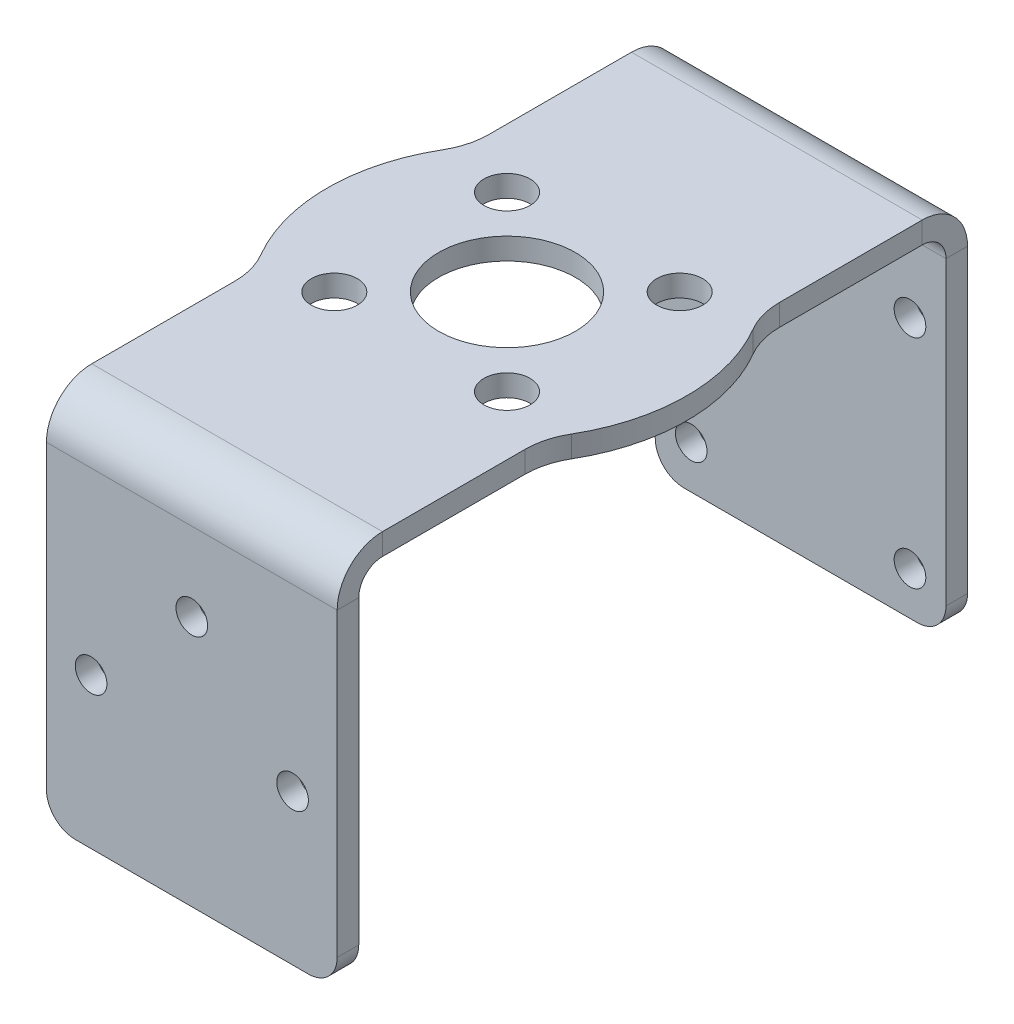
ISO-10303-21;
HEADER;
FILE_DESCRIPTION(('STEP AP214'),'2;1');
FILE_NAME('part.step','',(''),(''),'','','');
FILE_SCHEMA(('AUTOMOTIVE_DESIGN { 1 0 10303 214 1 1 1 1 }'));
ENDSEC;
DATA;
#1=APPLICATION_CONTEXT('core data for automotive mechanical design processes');
#2=APPLICATION_PROTOCOL_DEFINITION('international standard','automotive_design',2000,#1);
#3=PRODUCT_CONTEXT('',#1,'mechanical');
#4=PRODUCT('Part','Part','',(#3));
#5=PRODUCT_RELATED_PRODUCT_CATEGORY('part','',(#4));
#6=PRODUCT_DEFINITION_FORMATION('','',#4);
#7=PRODUCT_DEFINITION_CONTEXT('part definition',#1,'design');
#8=PRODUCT_DEFINITION('design','',#6,#7);
#9=PRODUCT_DEFINITION_SHAPE('','',#8);
#10=(LENGTH_UNIT() NAMED_UNIT(*) SI_UNIT(.MILLI.,.METRE.));
#11=(NAMED_UNIT(*) PLANE_ANGLE_UNIT() SI_UNIT($,.RADIAN.));
#12=(NAMED_UNIT(*) SI_UNIT($,.STERADIAN.) SOLID_ANGLE_UNIT());
#13=UNCERTAINTY_MEASURE_WITH_UNIT(LENGTH_MEASURE(1.E-05),#10,'distance_accuracy_value','');
#14=(GEOMETRIC_REPRESENTATION_CONTEXT(3) GLOBAL_UNCERTAINTY_ASSIGNED_CONTEXT((#13)) GLOBAL_UNIT_ASSIGNED_CONTEXT((#10,
#11,#12)) REPRESENTATION_CONTEXT('',''));
#15=CARTESIAN_POINT('',(0.,0.,0.));
#16=DIRECTION('',(0.,0.,1.));
#17=DIRECTION('',(1.,0.,0.));
#18=AXIS2_PLACEMENT_3D('',#15,#16,#17);
#19=CARTESIAN_POINT('',(10.1,-1.5,20.4));
#20=DIRECTION('',(1.,0.,0.));
#21=DIRECTION('',(0.,0.,-1.));
#22=AXIS2_PLACEMENT_3D('',#19,#20,#21);
#23=PLANE('',#22);
#24=DIRECTION('',(0.,0.,-1.));
#25=VECTOR('',#24,1.);
#26=CARTESIAN_POINT('',(10.1,0.,20.4));
#27=LINE('',#26,#25);
#28=CARTESIAN_POINT('',(10.1,0.,-8.8453377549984));
#29=VERTEX_POINT('',#28);
#30=CARTESIAN_POINT('',(10.1,0.,-18.75));
#31=VERTEX_POINT('',#30);
#32=EDGE_CURVE('E372',#29,#31,#27,.T.);
#33=ORIENTED_EDGE('',*,*,#32,.F.);
#34=DIRECTION('',(0.,-1.,0.));
#35=VECTOR('',#34,1.);
#36=CARTESIAN_POINT('',(10.1,-1.5,-8.8453377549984));
#37=LINE('',#36,#35);
#38=CARTESIAN_POINT('',(10.1,-1.5,-8.8453377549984));
#39=VERTEX_POINT('',#38);
#40=EDGE_CURVE('E435',#29,#39,#37,.T.);
#41=ORIENTED_EDGE('',*,*,#40,.T.);
#42=DIRECTION('',(0.,0.,-1.));
#43=VECTOR('',#42,1.);
#44=CARTESIAN_POINT('',(10.1,-1.5,20.4));
#45=LINE('',#44,#43);
#46=CARTESIAN_POINT('',(10.1,-1.50000000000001,-18.75));
#47=VERTEX_POINT('',#46);
#48=EDGE_CURVE('E362',#39,#47,#45,.T.);
#49=ORIENTED_EDGE('',*,*,#48,.T.);
#50=DIRECTION('',(0.,1.,0.));
#51=VECTOR('',#50,1.);
#52=CARTESIAN_POINT('',(10.1,-1.50000000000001,-18.75));
#53=LINE('',#52,#51);
#54=EDGE_CURVE('E274',#47,#31,#53,.T.);
#55=ORIENTED_EDGE('',*,*,#54,.T.);
#56=EDGE_LOOP('',(#33,#41,#49,#55));
#57=FACE_BOUND('',#56,.T.);
#58=ADVANCED_FACE('F46',(#57),#23,.T.);
#59=CARTESIAN_POINT('',(-10.1,-1.5,20.4));
#60=DIRECTION('',(-1.,0.,0.));
#61=DIRECTION('',(0.,0.,1.));
#62=AXIS2_PLACEMENT_3D('',#59,#60,#61);
#63=PLANE('',#62);
#64=DIRECTION('',(0.,0.,1.));
#65=VECTOR('',#64,1.);
#66=CARTESIAN_POINT('',(-10.1,0.,20.4));
#67=LINE('',#66,#65);
#68=CARTESIAN_POINT('',(-10.1,0.,8.8453377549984));
#69=VERTEX_POINT('',#68);
#70=CARTESIAN_POINT('',(-10.1,0.,18.75));
#71=VERTEX_POINT('',#70);
#72=EDGE_CURVE('E355',#69,#71,#67,.T.);
#73=ORIENTED_EDGE('',*,*,#72,.F.);
#74=DIRECTION('',(0.,-1.,0.));
#75=VECTOR('',#74,1.);
#76=CARTESIAN_POINT('',(-10.1,-1.5,8.8453377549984));
#77=LINE('',#76,#75);
#78=CARTESIAN_POINT('',(-10.1,-1.5,8.8453377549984));
#79=VERTEX_POINT('',#78);
#80=EDGE_CURVE('E449',#69,#79,#77,.T.);
#81=ORIENTED_EDGE('',*,*,#80,.T.);
#82=DIRECTION('',(0.,0.,1.));
#83=VECTOR('',#82,1.);
#84=CARTESIAN_POINT('',(-10.1,-1.5,20.4));
#85=LINE('',#84,#83);
#86=CARTESIAN_POINT('',(-10.1,-1.5,18.75));
#87=VERTEX_POINT('',#86);
#88=EDGE_CURVE('E363',#79,#87,#85,.T.);
#89=ORIENTED_EDGE('',*,*,#88,.T.);
#90=DIRECTION('',(0.,1.,0.));
#91=VECTOR('',#90,1.);
#92=CARTESIAN_POINT('',(-10.1,-1.5,18.75));
#93=LINE('',#92,#91);
#94=EDGE_CURVE('E337',#87,#71,#93,.T.);
#95=ORIENTED_EDGE('',*,*,#94,.T.);
#96=EDGE_LOOP('',(#73,#81,#89,#95));
#97=FACE_BOUND('',#96,.T.);
#98=ADVANCED_FACE('F840',(#97),#63,.T.);
#99=CARTESIAN_POINT('',(0.,0.,21.9));
#100=DIRECTION('',(0.,0.,-1.));
#101=DIRECTION('',(0.,1.,0.));
#102=AXIS2_PLACEMENT_3D('',#99,#100,#101);
#103=PLANE('',#102);
#104=CARTESIAN_POINT('',(7.00000000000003,-15.6000000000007,21.9));
#105=DIRECTION('',(0.,0.,1.));
#106=DIRECTION('',(1.,0.,0.));
#107=AXIS2_PLACEMENT_3D('',#104,#105,#106);
#108=CIRCLE('',#107,1.1);
#109=CARTESIAN_POINT('',(8.10000000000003,-15.6000000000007,21.9));
#110=VERTEX_POINT('',#109);
#111=EDGE_CURVE('E684',#110,#110,#108,.T.);
#112=ORIENTED_EDGE('',*,*,#111,.F.);
#113=EDGE_LOOP('',(#112));
#114=FACE_BOUND('',#113,.T.);
#115=DIRECTION('',(1.,0.,0.));
#116=VECTOR('',#115,1.);
#117=CARTESIAN_POINT('',(10.1,-26.05,21.9000000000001));
#118=LINE('',#117,#116);
#119=CARTESIAN_POINT('',(-8.10000000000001,-26.05,21.9000000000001));
#120=VERTEX_POINT('',#119);
#121=CARTESIAN_POINT('',(8.09999999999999,-26.05,21.9000000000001));
#122=VERTEX_POINT('',#121);
#123=EDGE_CURVE('E310',#120,#122,#118,.T.);
#124=ORIENTED_EDGE('',*,*,#123,.T.);
#125=CARTESIAN_POINT('',(8.09999999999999,-24.05,21.9000000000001));
#126=DIRECTION('',(0.,0.,-1.));
#127=DIRECTION('',(0.,1.,0.));
#128=AXIS2_PLACEMENT_3D('',#125,#126,#127);
#129=CIRCLE('',#128,2.);
#130=CARTESIAN_POINT('',(10.1,-24.05,21.9000000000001));
#131=VERTEX_POINT('',#130);
#132=EDGE_CURVE('E396',#122,#131,#129,.F.);
#133=ORIENTED_EDGE('',*,*,#132,.T.);
#134=DIRECTION('',(0.,1.,0.));
#135=VECTOR('',#134,1.);
#136=CARTESIAN_POINT('',(10.1,-1.49999999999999,21.9));
#137=LINE('',#136,#135);
#138=CARTESIAN_POINT('',(10.1,-3.14999999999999,21.9));
#139=VERTEX_POINT('',#138);
#140=EDGE_CURVE('E315',#131,#139,#137,.T.);
#141=ORIENTED_EDGE('',*,*,#140,.T.);
#142=DIRECTION('',(1.,0.,0.));
#143=VECTOR('',#142,1.);
#144=CARTESIAN_POINT('',(0.,-3.15,21.9));
#145=LINE('',#144,#143);
#146=CARTESIAN_POINT('',(-10.1,-3.15,21.9));
#147=VERTEX_POINT('',#146);
#148=EDGE_CURVE('E298',#147,#139,#145,.T.);
#149=ORIENTED_EDGE('',*,*,#148,.F.);
#150=DIRECTION('',(0.,-1.,0.));
#151=VECTOR('',#150,1.);
#152=CARTESIAN_POINT('',(-10.1,-26.05,21.9000000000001));
#153=LINE('',#152,#151);
#154=CARTESIAN_POINT('',(-10.1,-24.05,21.9000000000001));
#155=VERTEX_POINT('',#154);
#156=EDGE_CURVE('E306',#147,#155,#153,.T.);
#157=ORIENTED_EDGE('',*,*,#156,.T.);
#158=CARTESIAN_POINT('',(-8.10000000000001,-24.05,21.9000000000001));
#159=DIRECTION('',(0.,0.,-1.));
#160=DIRECTION('',(0.,1.,0.));
#161=AXIS2_PLACEMENT_3D('',#158,#159,#160);
#162=CIRCLE('',#161,2.);
#163=EDGE_CURVE('E393',#155,#120,#162,.F.);
#164=ORIENTED_EDGE('',*,*,#163,.T.);
#165=EDGE_LOOP('',(#124,#133,#141,#149,#157,#164));
#166=FACE_BOUND('',#165,.T.);
#167=CARTESIAN_POINT('',(0.,-8.60000000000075,21.9));
#168=DIRECTION('',(0.,0.,1.));
#169=DIRECTION('',(1.,0.,0.));
#170=AXIS2_PLACEMENT_3D('',#167,#168,#169);
#171=CIRCLE('',#170,1.1);
#172=CARTESIAN_POINT('',(1.09999999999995,-8.60000000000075,21.9));
#173=VERTEX_POINT('',#172);
#174=EDGE_CURVE('E696',#173,#173,#171,.T.);
#175=ORIENTED_EDGE('',*,*,#174,.F.);
#176=EDGE_LOOP('',(#175));
#177=FACE_BOUND('',#176,.T.);
#178=CARTESIAN_POINT('',(-6.99999999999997,-15.6000000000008,21.9));
#179=DIRECTION('',(0.,0.,1.));
#180=DIRECTION('',(1.,0.,0.));
#181=AXIS2_PLACEMENT_3D('',#178,#179,#180);
#182=CIRCLE('',#181,1.1);
#183=CARTESIAN_POINT('',(-5.89999999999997,-15.6000000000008,21.9));
#184=VERTEX_POINT('',#183);
#185=EDGE_CURVE('E708',#184,#184,#182,.T.);
#186=ORIENTED_EDGE('',*,*,#185,.F.);
#187=EDGE_LOOP('',(#186));
#188=FACE_BOUND('',#187,.T.);
#189=ADVANCED_FACE('F805',(#114,#166,#177,#188),#103,.F.);
#190=CARTESIAN_POINT('',(0.,-1.5,0.));
#191=DIRECTION('',(0.,1.,0.));
#192=DIRECTION('',(0.,0.,1.));
#193=AXIS2_PLACEMENT_3D('',#190,#191,#192);
#194=PLANE('',#193);
#195=CARTESIAN_POINT('',(6.,-1.5,-6.));
#196=DIRECTION('',(0.,1.,0.));
#197=DIRECTION('',(0.,0.,1.));
#198=AXIS2_PLACEMENT_3D('',#195,#196,#197);
#199=CIRCLE('',#198,1.6);
#200=CARTESIAN_POINT('',(6.,-1.5,-4.4));
#201=VERTEX_POINT('',#200);
#202=EDGE_CURVE('E754',#201,#201,#199,.F.);
#203=ORIENTED_EDGE('',*,*,#202,.F.);
#204=EDGE_LOOP('',(#203));
#205=FACE_BOUND('',#204,.T.);
#206=CARTESIAN_POINT('',(-6.,-1.5,6.));
#207=DIRECTION('',(0.,1.,0.));
#208=DIRECTION('',(0.,0.,1.));
#209=AXIS2_PLACEMENT_3D('',#206,#207,#208);
#210=CIRCLE('',#209,1.6);
#211=CARTESIAN_POINT('',(-6.,-1.5,7.6));
#212=VERTEX_POINT('',#211);
#213=EDGE_CURVE('E766',#212,#212,#210,.F.);
#214=ORIENTED_EDGE('',*,*,#213,.F.);
#215=EDGE_LOOP('',(#214));
#216=FACE_BOUND('',#215,.T.);
#217=CARTESIAN_POINT('',(0.,-1.5,0.));
#218=DIRECTION('',(0.,1.,0.));
#219=DIRECTION('',(0.,0.,1.));
#220=AXIS2_PLACEMENT_3D('',#217,#218,#219);
#221=CIRCLE('',#220,4.75);
#222=CARTESIAN_POINT('',(0.,-1.5,4.75));
#223=VERTEX_POINT('',#222);
#224=EDGE_CURVE('E790',#223,#223,#221,.F.);
#225=ORIENTED_EDGE('',*,*,#224,.F.);
#226=EDGE_LOOP('',(#225));
#227=FACE_BOUND('',#226,.T.);
#228=CARTESIAN_POINT('',(6.,-1.5,6.));
#229=DIRECTION('',(0.,1.,0.));
#230=DIRECTION('',(0.,0.,1.));
#231=AXIS2_PLACEMENT_3D('',#228,#229,#230);
#232=CIRCLE('',#231,1.6);
#233=CARTESIAN_POINT('',(6.,-1.5,7.6));
#234=VERTEX_POINT('',#233);
#235=EDGE_CURVE('E778',#234,#234,#232,.F.);
#236=ORIENTED_EDGE('',*,*,#235,.F.);
#237=EDGE_LOOP('',(#236));
#238=FACE_BOUND('',#237,.T.);
#239=CARTESIAN_POINT('',(-6.,-1.5,-6.));
#240=DIRECTION('',(0.,1.,0.));
#241=DIRECTION('',(0.,0.,1.));
#242=AXIS2_PLACEMENT_3D('',#239,#240,#241);
#243=CIRCLE('',#242,1.6);
#244=CARTESIAN_POINT('',(-6.,-1.5,-4.4));
#245=VERTEX_POINT('',#244);
#246=EDGE_CURVE('E737',#245,#245,#243,.F.);
#247=ORIENTED_EDGE('',*,*,#246,.F.);
#248=EDGE_LOOP('',(#247));
#249=FACE_BOUND('',#248,.T.);
#250=ORIENTED_EDGE('',*,*,#88,.F.);
#251=CARTESIAN_POINT('',(-15.1,-1.5,8.8453377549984));
#252=DIRECTION('',(0.,1.,0.));
#253=DIRECTION('',(0.,0.,1.));
#254=AXIS2_PLACEMENT_3D('',#251,#252,#253);
#255=CIRCLE('',#254,5.);
#256=CARTESIAN_POINT('',(-10.7857142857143,-1.5,6.31809839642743));
#257=VERTEX_POINT('',#256);
#258=EDGE_CURVE('E469',#79,#257,#255,.T.);
#259=ORIENTED_EDGE('',*,*,#258,.T.);
#260=CARTESIAN_POINT('',(0.,-1.5,0.));
#261=DIRECTION('',(0.,1.,0.));
#262=DIRECTION('',(0.,0.,1.));
#263=AXIS2_PLACEMENT_3D('',#260,#261,#262);
#264=CIRCLE('',#263,12.5);
#265=CARTESIAN_POINT('',(-10.7857142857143,-1.5,-6.31809839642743));
#266=VERTEX_POINT('',#265);
#267=EDGE_CURVE('E720',#266,#257,#264,.T.);
#268=ORIENTED_EDGE('',*,*,#267,.F.);
#269=CARTESIAN_POINT('',(-15.1,-1.5,-8.8453377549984));
#270=DIRECTION('',(0.,1.,0.));
#271=DIRECTION('',(0.,0.,1.));
#272=AXIS2_PLACEMENT_3D('',#269,#270,#271);
#273=CIRCLE('',#272,5.);
#274=CARTESIAN_POINT('',(-10.1,-1.5,-8.8453377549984));
#275=VERTEX_POINT('',#274);
#276=EDGE_CURVE('E55',#266,#275,#273,.T.);
#277=ORIENTED_EDGE('',*,*,#276,.T.);
#278=CARTESIAN_POINT('',(-10.1,-1.50000000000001,-18.75));
#279=VERTEX_POINT('',#278);
#280=EDGE_CURVE('E359',#279,#275,#85,.T.);
#281=ORIENTED_EDGE('',*,*,#280,.F.);
#282=DIRECTION('',(1.,0.,0.));
#283=VECTOR('',#282,1.);
#284=CARTESIAN_POINT('',(10.1,-1.50000000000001,-18.75));
#285=LINE('',#284,#283);
#286=EDGE_CURVE('E279',#47,#279,#285,.F.);
#287=ORIENTED_EDGE('',*,*,#286,.F.);
#288=ORIENTED_EDGE('',*,*,#48,.F.);
#289=CARTESIAN_POINT('',(15.1,-1.5,-8.8453377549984));
#290=DIRECTION('',(0.,1.,0.));
#291=DIRECTION('',(0.,0.,1.));
#292=AXIS2_PLACEMENT_3D('',#289,#290,#291);
#293=CIRCLE('',#292,5.);
#294=CARTESIAN_POINT('',(10.7857142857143,-1.5,-6.31809839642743));
#295=VERTEX_POINT('',#294);
#296=EDGE_CURVE('E457',#39,#295,#293,.T.);
#297=ORIENTED_EDGE('',*,*,#296,.T.);
#298=CARTESIAN_POINT('',(10.7857142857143,-1.5,6.31809839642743));
#299=VERTEX_POINT('',#298);
#300=EDGE_CURVE('E714',#299,#295,#264,.T.);
#301=ORIENTED_EDGE('',*,*,#300,.F.);
#302=CARTESIAN_POINT('',(15.1,-1.5,8.8453377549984));
#303=DIRECTION('',(0.,1.,0.));
#304=DIRECTION('',(0.,0.,1.));
#305=AXIS2_PLACEMENT_3D('',#302,#303,#304);
#306=CIRCLE('',#305,5.);
#307=CARTESIAN_POINT('',(10.1,-1.5,8.8453377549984));
#308=VERTEX_POINT('',#307);
#309=EDGE_CURVE('E460',#299,#308,#306,.T.);
#310=ORIENTED_EDGE('',*,*,#309,.T.);
#311=CARTESIAN_POINT('',(10.1,-1.5,18.75));
#312=VERTEX_POINT('',#311);
#313=EDGE_CURVE('E364',#312,#308,#45,.T.);
#314=ORIENTED_EDGE('',*,*,#313,.F.);
#315=DIRECTION('',(-1.,0.,0.));
#316=VECTOR('',#315,1.);
#317=CARTESIAN_POINT('',(-10.1,-1.5,18.75));
#318=LINE('',#317,#316);
#319=EDGE_CURVE('E345',#87,#312,#318,.F.);
#320=ORIENTED_EDGE('',*,*,#319,.F.);
#321=EDGE_LOOP('',(#250,#259,#268,#277,#281,#287,#288,#297,#301,#310,#314,#320));
#322=FACE_BOUND('',#321,.T.);
#323=ADVANCED_FACE('F801',(#205,#216,#227,#238,#249,#322),#194,.F.);
#324=CARTESIAN_POINT('',(0.,0.,0.));
#325=DIRECTION('',(0.,1.,0.));
#326=DIRECTION('',(0.,0.,1.));
#327=AXIS2_PLACEMENT_3D('',#324,#325,#326);
#328=PLANE('',#327);
#329=CARTESIAN_POINT('',(6.,0.,-6.));
#330=DIRECTION('',(0.,1.,0.));
#331=DIRECTION('',(0.,0.,1.));
#332=AXIS2_PLACEMENT_3D('',#329,#330,#331);
#333=CIRCLE('',#332,1.6);
#334=CARTESIAN_POINT('',(6.,0.,-4.4));
#335=VERTEX_POINT('',#334);
#336=EDGE_CURVE('E748',#335,#335,#333,.T.);
#337=ORIENTED_EDGE('',*,*,#336,.F.);
#338=EDGE_LOOP('',(#337));
#339=FACE_BOUND('',#338,.T.);
#340=CARTESIAN_POINT('',(-6.,0.,6.));
#341=DIRECTION('',(0.,1.,0.));
#342=DIRECTION('',(0.,0.,1.));
#343=AXIS2_PLACEMENT_3D('',#340,#341,#342);
#344=CIRCLE('',#343,1.6);
#345=CARTESIAN_POINT('',(-6.,0.,7.6));
#346=VERTEX_POINT('',#345);
#347=EDGE_CURVE('E760',#346,#346,#344,.T.);
#348=ORIENTED_EDGE('',*,*,#347,.F.);
#349=EDGE_LOOP('',(#348));
#350=FACE_BOUND('',#349,.T.);
#351=CARTESIAN_POINT('',(0.,0.,0.));
#352=DIRECTION('',(0.,1.,0.));
#353=DIRECTION('',(0.,0.,1.));
#354=AXIS2_PLACEMENT_3D('',#351,#352,#353);
#355=CIRCLE('',#354,4.75);
#356=CARTESIAN_POINT('',(0.,0.,4.75));
#357=VERTEX_POINT('',#356);
#358=EDGE_CURVE('E784',#357,#357,#355,.T.);
#359=ORIENTED_EDGE('',*,*,#358,.F.);
#360=EDGE_LOOP('',(#359));
#361=FACE_BOUND('',#360,.T.);
#362=CARTESIAN_POINT('',(6.,0.,6.));
#363=DIRECTION('',(0.,1.,0.));
#364=DIRECTION('',(0.,0.,1.));
#365=AXIS2_PLACEMENT_3D('',#362,#363,#364);
#366=CIRCLE('',#365,1.6);
#367=CARTESIAN_POINT('',(6.,0.,7.6));
#368=VERTEX_POINT('',#367);
#369=EDGE_CURVE('E772',#368,#368,#366,.T.);
#370=ORIENTED_EDGE('',*,*,#369,.F.);
#371=EDGE_LOOP('',(#370));
#372=FACE_BOUND('',#371,.T.);
#373=CARTESIAN_POINT('',(-6.,0.,-6.));
#374=DIRECTION('',(0.,1.,0.));
#375=DIRECTION('',(0.,0.,1.));
#376=AXIS2_PLACEMENT_3D('',#373,#374,#375);
#377=CIRCLE('',#376,1.6);
#378=CARTESIAN_POINT('',(-6.,0.,-4.4));
#379=VERTEX_POINT('',#378);
#380=EDGE_CURVE('E742',#379,#379,#377,.T.);
#381=ORIENTED_EDGE('',*,*,#380,.F.);
#382=EDGE_LOOP('',(#381));
#383=FACE_BOUND('',#382,.T.);
#384=CARTESIAN_POINT('',(10.1,0.,18.75));
#385=VERTEX_POINT('',#384);
#386=CARTESIAN_POINT('',(10.1,0.,8.8453377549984));
#387=VERTEX_POINT('',#386);
#388=EDGE_CURVE('E373',#385,#387,#27,.T.);
#389=ORIENTED_EDGE('',*,*,#388,.T.);
#390=CARTESIAN_POINT('',(15.1,0.,8.8453377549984));
#391=DIRECTION('',(0.,1.,0.));
#392=DIRECTION('',(0.,0.,1.));
#393=AXIS2_PLACEMENT_3D('',#390,#391,#392);
#394=CIRCLE('',#393,5.);
#395=CARTESIAN_POINT('',(10.7857142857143,0.,6.31809839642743));
#396=VERTEX_POINT('',#395);
#397=EDGE_CURVE('E463',#387,#396,#394,.F.);
#398=ORIENTED_EDGE('',*,*,#397,.T.);
#399=CARTESIAN_POINT('',(0.,0.,0.));
#400=DIRECTION('',(0.,1.,0.));
#401=DIRECTION('',(0.,0.,1.));
#402=AXIS2_PLACEMENT_3D('',#399,#400,#401);
#403=CIRCLE('',#402,12.5);
#404=CARTESIAN_POINT('',(10.7857142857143,0.,-6.31809839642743));
#405=VERTEX_POINT('',#404);
#406=EDGE_CURVE('E726',#396,#405,#403,.T.);
#407=ORIENTED_EDGE('',*,*,#406,.T.);
#408=CARTESIAN_POINT('',(15.1,0.,-8.8453377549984));
#409=DIRECTION('',(0.,1.,0.));
#410=DIRECTION('',(0.,0.,1.));
#411=AXIS2_PLACEMENT_3D('',#408,#409,#410);
#412=CIRCLE('',#411,5.);
#413=EDGE_CURVE('E454',#405,#29,#412,.F.);
#414=ORIENTED_EDGE('',*,*,#413,.T.);
#415=ORIENTED_EDGE('',*,*,#32,.T.);
#416=DIRECTION('',(1.,0.,0.));
#417=VECTOR('',#416,1.);
#418=CARTESIAN_POINT('',(10.1,0.,-18.75));
#419=LINE('',#418,#417);
#420=CARTESIAN_POINT('',(-10.1,0.,-18.75));
#421=VERTEX_POINT('',#420);
#422=EDGE_CURVE('E216',#31,#421,#419,.F.);
#423=ORIENTED_EDGE('',*,*,#422,.T.);
#424=CARTESIAN_POINT('',(-10.1,0.,-8.8453377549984));
#425=VERTEX_POINT('',#424);
#426=EDGE_CURVE('E369',#421,#425,#67,.T.);
#427=ORIENTED_EDGE('',*,*,#426,.T.);
#428=CARTESIAN_POINT('',(-15.1,0.,-8.8453377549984));
#429=DIRECTION('',(0.,1.,0.));
#430=DIRECTION('',(0.,0.,1.));
#431=AXIS2_PLACEMENT_3D('',#428,#429,#430);
#432=CIRCLE('',#431,5.);
#433=CARTESIAN_POINT('',(-10.7857142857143,0.,-6.31809839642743));
#434=VERTEX_POINT('',#433);
#435=EDGE_CURVE('E11',#425,#434,#432,.F.);
#436=ORIENTED_EDGE('',*,*,#435,.T.);
#437=CARTESIAN_POINT('',(-10.7857142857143,0.,6.31809839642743));
#438=VERTEX_POINT('',#437);
#439=EDGE_CURVE('E731',#434,#438,#403,.T.);
#440=ORIENTED_EDGE('',*,*,#439,.T.);
#441=CARTESIAN_POINT('',(-15.1,0.,8.8453377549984));
#442=DIRECTION('',(0.,1.,0.));
#443=DIRECTION('',(0.,0.,1.));
#444=AXIS2_PLACEMENT_3D('',#441,#442,#443);
#445=CIRCLE('',#444,5.);
#446=EDGE_CURVE('E466',#438,#69,#445,.F.);
#447=ORIENTED_EDGE('',*,*,#446,.T.);
#448=ORIENTED_EDGE('',*,*,#72,.T.);
#449=DIRECTION('',(-1.,0.,0.));
#450=VECTOR('',#449,1.);
#451=CARTESIAN_POINT('',(-10.1,0.,18.75));
#452=LINE('',#451,#450);
#453=EDGE_CURVE('E328',#71,#385,#452,.F.);
#454=ORIENTED_EDGE('',*,*,#453,.T.);
#455=EDGE_LOOP('',(#389,#398,#407,#414,#415,#423,#427,#436,#440,#447,#448,#454));
#456=FACE_BOUND('',#455,.T.);
#457=ADVANCED_FACE('F804',(#339,#350,#361,#372,#383,#456),#328,.T.);
#458=ORIENTED_EDGE('',*,*,#313,.T.);
#459=DIRECTION('',(0.,-1.,0.));
#460=VECTOR('',#459,1.);
#461=CARTESIAN_POINT('',(10.1,0.,8.8453377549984));
#462=LINE('',#461,#460);
#463=EDGE_CURVE('E438',#308,#387,#462,.F.);
#464=ORIENTED_EDGE('',*,*,#463,.T.);
#465=ORIENTED_EDGE('',*,*,#388,.F.);
#466=DIRECTION('',(0.,1.,0.));
#467=VECTOR('',#466,1.);
#468=CARTESIAN_POINT('',(10.1,-1.5,18.75));
#469=LINE('',#468,#467);
#470=EDGE_CURVE('E351',#312,#385,#469,.T.);
#471=ORIENTED_EDGE('',*,*,#470,.F.);
#472=EDGE_LOOP('',(#458,#464,#465,#471));
#473=FACE_BOUND('',#472,.T.);
#474=ADVANCED_FACE('F843',(#473),#23,.T.);
#475=ORIENTED_EDGE('',*,*,#280,.T.);
#476=DIRECTION('',(0.,-1.,0.));
#477=VECTOR('',#476,1.);
#478=CARTESIAN_POINT('',(-10.1,0.,-8.8453377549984));
#479=LINE('',#478,#477);
#480=EDGE_CURVE('E68',#275,#425,#479,.F.);
#481=ORIENTED_EDGE('',*,*,#480,.T.);
#482=ORIENTED_EDGE('',*,*,#426,.F.);
#483=DIRECTION('',(0.,1.,0.));
#484=VECTOR('',#483,1.);
#485=CARTESIAN_POINT('',(-10.1,-1.50000000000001,-18.75));
#486=LINE('',#485,#484);
#487=EDGE_CURVE('E284',#279,#421,#486,.T.);
#488=ORIENTED_EDGE('',*,*,#487,.F.);
#489=EDGE_LOOP('',(#475,#481,#482,#488));
#490=FACE_BOUND('',#489,.T.);
#491=ADVANCED_FACE('F848',(#490),#63,.T.);
#492=CARTESIAN_POINT('',(10.1,-3.15,18.75));
#493=DIRECTION('',(1.,0.,0.));
#494=DIRECTION('',(0.,0.,-1.));
#495=AXIS2_PLACEMENT_3D('',#492,#493,#494);
#496=PLANE('',#495);
#497=DIRECTION('',(0.,0.,1.));
#498=VECTOR('',#497,1.);
#499=CARTESIAN_POINT('',(10.1,-3.15,20.4));
#500=LINE('',#499,#498);
#501=CARTESIAN_POINT('',(10.1,-3.14999999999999,20.4));
#502=VERTEX_POINT('',#501);
#503=EDGE_CURVE('E288',#502,#139,#500,.T.);
#504=ORIENTED_EDGE('',*,*,#503,.F.);
#505=CARTESIAN_POINT('',(10.1,-3.15,18.75));
#506=DIRECTION('',(-1.,0.,0.));
#507=DIRECTION('',(0.,0.,1.));
#508=AXIS2_PLACEMENT_3D('',#505,#506,#507);
#509=CIRCLE('',#508,1.65);
#510=EDGE_CURVE('E341',#312,#502,#509,.F.);
#511=ORIENTED_EDGE('',*,*,#510,.F.);
#512=ORIENTED_EDGE('',*,*,#470,.T.);
#513=CARTESIAN_POINT('',(10.1,-3.15,18.75));
#514=DIRECTION('',(-1.,0.,0.));
#515=DIRECTION('',(0.,0.,1.));
#516=AXIS2_PLACEMENT_3D('',#513,#514,#515);
#517=CIRCLE('',#516,3.15);
#518=EDGE_CURVE('E332',#385,#139,#517,.F.);
#519=ORIENTED_EDGE('',*,*,#518,.T.);
#520=EDGE_LOOP('',(#504,#511,#512,#519));
#521=FACE_BOUND('',#520,.T.);
#522=ADVANCED_FACE('F857',(#521),#496,.T.);
#523=CARTESIAN_POINT('',(-10.1,-3.15,18.75));
#524=DIRECTION('',(1.,0.,0.));
#525=DIRECTION('',(0.,0.,-1.));
#526=AXIS2_PLACEMENT_3D('',#523,#524,#525);
#527=PLANE('',#526);
#528=CARTESIAN_POINT('',(-10.1,-3.15,18.75));
#529=DIRECTION('',(-1.,0.,0.));
#530=DIRECTION('',(0.,0.,1.));
#531=AXIS2_PLACEMENT_3D('',#528,#529,#530);
#532=CIRCLE('',#531,1.65);
#533=CARTESIAN_POINT('',(-10.1,-3.14999999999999,20.4));
#534=VERTEX_POINT('',#533);
#535=EDGE_CURVE('E318',#534,#87,#532,.T.);
#536=ORIENTED_EDGE('',*,*,#535,.F.);
#537=DIRECTION('',(0.,0.,1.));
#538=VECTOR('',#537,1.);
#539=CARTESIAN_POINT('',(-10.1,-3.15,20.4));
#540=LINE('',#539,#538);
#541=EDGE_CURVE('E294',#534,#147,#540,.T.);
#542=ORIENTED_EDGE('',*,*,#541,.T.);
#543=CARTESIAN_POINT('',(-10.1,-3.15,18.75));
#544=DIRECTION('',(-1.,0.,0.));
#545=DIRECTION('',(0.,0.,1.));
#546=AXIS2_PLACEMENT_3D('',#543,#544,#545);
#547=CIRCLE('',#546,3.15);
#548=EDGE_CURVE('E333',#147,#71,#547,.T.);
#549=ORIENTED_EDGE('',*,*,#548,.T.);
#550=ORIENTED_EDGE('',*,*,#94,.F.);
#551=EDGE_LOOP('',(#536,#542,#549,#550));
#552=FACE_BOUND('',#551,.T.);
#553=ADVANCED_FACE('F946',(#552),#527,.F.);
#554=CARTESIAN_POINT('',(-10.1,-3.15,18.75));
#555=DIRECTION('',(-1.,0.,0.));
#556=DIRECTION('',(0.,0.,1.));
#557=AXIS2_PLACEMENT_3D('',#554,#555,#556);
#558=CYLINDRICAL_SURFACE('',#557,3.15);
#559=ORIENTED_EDGE('',*,*,#453,.F.);
#560=ORIENTED_EDGE('',*,*,#548,.F.);
#561=ORIENTED_EDGE('',*,*,#148,.T.);
#562=ORIENTED_EDGE('',*,*,#518,.F.);
#563=EDGE_LOOP('',(#559,#560,#561,#562));
#564=FACE_BOUND('',#563,.T.);
#565=ADVANCED_FACE('F943',(#564),#558,.T.);
#566=CARTESIAN_POINT('',(-10.1,-3.15,18.75));
#567=DIRECTION('',(-1.,0.,0.));
#568=DIRECTION('',(0.,0.,1.));
#569=AXIS2_PLACEMENT_3D('',#566,#567,#568);
#570=CYLINDRICAL_SURFACE('',#569,1.65);
#571=ORIENTED_EDGE('',*,*,#319,.T.);
#572=ORIENTED_EDGE('',*,*,#510,.T.);
#573=DIRECTION('',(-1.,0.,0.));
#574=VECTOR('',#573,1.);
#575=CARTESIAN_POINT('',(10.1,-3.15,20.4));
#576=LINE('',#575,#574);
#577=EDGE_CURVE('E291',#502,#534,#576,.T.);
#578=ORIENTED_EDGE('',*,*,#577,.T.);
#579=ORIENTED_EDGE('',*,*,#535,.T.);
#580=EDGE_LOOP('',(#571,#572,#578,#579));
#581=FACE_BOUND('',#580,.T.);
#582=ADVANCED_FACE('F941',(#581),#570,.F.);
#583=CARTESIAN_POINT('',(-10.1,-26.05,21.9000000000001));
#584=DIRECTION('',(1.,0.,0.));
#585=DIRECTION('',(0.,1.,0.));
#586=AXIS2_PLACEMENT_3D('',#583,#584,#585);
#587=PLANE('',#586);
#588=DIRECTION('',(0.,-1.,0.));
#589=VECTOR('',#588,1.);
#590=CARTESIAN_POINT('',(-10.1,-26.05,20.4000000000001));
#591=LINE('',#590,#589);
#592=CARTESIAN_POINT('',(-10.1,-24.05,20.4000000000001));
#593=VERTEX_POINT('',#592);
#594=EDGE_CURVE('E305',#534,#593,#591,.T.);
#595=ORIENTED_EDGE('',*,*,#594,.T.);
#596=DIRECTION('',(0.,0.,-1.));
#597=VECTOR('',#596,1.);
#598=CARTESIAN_POINT('',(-10.1,-24.05,21.9000000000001));
#599=LINE('',#598,#597);
#600=EDGE_CURVE('E399',#593,#155,#599,.F.);
#601=ORIENTED_EDGE('',*,*,#600,.T.);
#602=ORIENTED_EDGE('',*,*,#156,.F.);
#603=ORIENTED_EDGE('',*,*,#541,.F.);
#604=EDGE_LOOP('',(#595,#601,#602,#603));
#605=FACE_BOUND('',#604,.T.);
#606=ADVANCED_FACE('F934',(#605),#587,.F.);
#607=CARTESIAN_POINT('',(10.1,-1.49999999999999,21.9));
#608=DIRECTION('',(-1.,0.,0.));
#609=DIRECTION('',(0.,-1.,0.));
#610=AXIS2_PLACEMENT_3D('',#607,#608,#609);
#611=PLANE('',#610);
#612=ORIENTED_EDGE('',*,*,#140,.F.);
#613=DIRECTION('',(0.,0.,-1.));
#614=VECTOR('',#613,1.);
#615=CARTESIAN_POINT('',(10.1,-24.05,21.9000000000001));
#616=LINE('',#615,#614);
#617=CARTESIAN_POINT('',(10.1,-24.05,20.4000000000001));
#618=VERTEX_POINT('',#617);
#619=EDGE_CURVE('E368',#131,#618,#616,.T.);
#620=ORIENTED_EDGE('',*,*,#619,.T.);
#621=DIRECTION('',(0.,1.,0.));
#622=VECTOR('',#621,1.);
#623=CARTESIAN_POINT('',(10.1,-1.5,20.4));
#624=LINE('',#623,#622);
#625=EDGE_CURVE('E311',#618,#502,#624,.T.);
#626=ORIENTED_EDGE('',*,*,#625,.T.);
#627=ORIENTED_EDGE('',*,*,#503,.T.);
#628=EDGE_LOOP('',(#612,#620,#626,#627));
#629=FACE_BOUND('',#628,.T.);
#630=ADVANCED_FACE('F930',(#629),#611,.F.);
#631=CARTESIAN_POINT('',(0.,0.,20.4));
#632=DIRECTION('',(0.,0.,-1.));
#633=DIRECTION('',(0.,1.,0.));
#634=AXIS2_PLACEMENT_3D('',#631,#632,#633);
#635=PLANE('',#634);
#636=CARTESIAN_POINT('',(-6.99999999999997,-15.6000000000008,20.4));
#637=DIRECTION('',(0.,0.,-1.));
#638=DIRECTION('',(0.,1.,0.));
#639=AXIS2_PLACEMENT_3D('',#636,#637,#638);
#640=CIRCLE('',#639,1.1);
#641=CARTESIAN_POINT('',(-6.99999999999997,-14.5000000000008,20.4));
#642=VERTEX_POINT('',#641);
#643=EDGE_CURVE('E702',#642,#642,#640,.T.);
#644=ORIENTED_EDGE('',*,*,#643,.F.);
#645=EDGE_LOOP('',(#644));
#646=FACE_BOUND('',#645,.T.);
#647=CARTESIAN_POINT('',(0.,-8.60000000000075,20.4));
#648=DIRECTION('',(0.,0.,-1.));
#649=DIRECTION('',(0.,1.,0.));
#650=AXIS2_PLACEMENT_3D('',#647,#648,#649);
#651=CIRCLE('',#650,1.1);
#652=CARTESIAN_POINT('',(0.,-7.50000000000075,20.4));
#653=VERTEX_POINT('',#652);
#654=EDGE_CURVE('E690',#653,#653,#651,.T.);
#655=ORIENTED_EDGE('',*,*,#654,.F.);
#656=EDGE_LOOP('',(#655));
#657=FACE_BOUND('',#656,.T.);
#658=CARTESIAN_POINT('',(7.00000000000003,-15.6000000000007,20.4));
#659=DIRECTION('',(0.,0.,-1.));
#660=DIRECTION('',(0.,1.,0.));
#661=AXIS2_PLACEMENT_3D('',#658,#659,#660);
#662=CIRCLE('',#661,1.1);
#663=CARTESIAN_POINT('',(7.00000000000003,-14.5000000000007,20.4));
#664=VERTEX_POINT('',#663);
#665=EDGE_CURVE('E678',#664,#664,#662,.T.);
#666=ORIENTED_EDGE('',*,*,#665,.F.);
#667=EDGE_LOOP('',(#666));
#668=FACE_BOUND('',#667,.T.);
#669=ORIENTED_EDGE('',*,*,#625,.F.);
#670=CARTESIAN_POINT('',(8.09999999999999,-24.05,20.4000000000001));
#671=DIRECTION('',(0.,0.,-1.));
#672=DIRECTION('',(0.,1.,0.));
#673=AXIS2_PLACEMENT_3D('',#670,#671,#672);
#674=CIRCLE('',#673,2.);
#675=CARTESIAN_POINT('',(8.09999999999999,-26.05,20.4000000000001));
#676=VERTEX_POINT('',#675);
#677=EDGE_CURVE('E383',#618,#676,#674,.T.);
#678=ORIENTED_EDGE('',*,*,#677,.T.);
#679=DIRECTION('',(1.,0.,0.));
#680=VECTOR('',#679,1.);
#681=CARTESIAN_POINT('',(10.1,-26.05,20.4000000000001));
#682=LINE('',#681,#680);
#683=CARTESIAN_POINT('',(-8.10000000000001,-26.05,20.4000000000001));
#684=VERTEX_POINT('',#683);
#685=EDGE_CURVE('E322',#684,#676,#682,.T.);
#686=ORIENTED_EDGE('',*,*,#685,.F.);
#687=CARTESIAN_POINT('',(-8.10000000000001,-24.05,20.4000000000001));
#688=DIRECTION('',(0.,0.,-1.));
#689=DIRECTION('',(0.,1.,0.));
#690=AXIS2_PLACEMENT_3D('',#687,#688,#689);
#691=CIRCLE('',#690,2.);
#692=EDGE_CURVE('E380',#684,#593,#691,.T.);
#693=ORIENTED_EDGE('',*,*,#692,.T.);
#694=ORIENTED_EDGE('',*,*,#594,.F.);
#695=ORIENTED_EDGE('',*,*,#577,.F.);
#696=EDGE_LOOP('',(#669,#678,#686,#693,#694,#695));
#697=FACE_BOUND('',#696,.T.);
#698=ADVANCED_FACE('F927',(#646,#657,#668,#697),#635,.T.);
#699=CARTESIAN_POINT('',(10.1,-26.05,21.9000000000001));
#700=DIRECTION('',(0.,1.,0.));
#701=DIRECTION('',(0.,0.,1.));
#702=AXIS2_PLACEMENT_3D('',#699,#700,#701);
#703=PLANE('',#702);
#704=ORIENTED_EDGE('',*,*,#685,.T.);
#705=DIRECTION('',(0.,0.,-1.));
#706=VECTOR('',#705,1.);
#707=CARTESIAN_POINT('',(8.09999999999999,-26.05,21.9000000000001));
#708=LINE('',#707,#706);
#709=EDGE_CURVE('E390',#676,#122,#708,.F.);
#710=ORIENTED_EDGE('',*,*,#709,.T.);
#711=ORIENTED_EDGE('',*,*,#123,.F.);
#712=DIRECTION('',(0.,0.,-1.));
#713=VECTOR('',#712,1.);
#714=CARTESIAN_POINT('',(-8.10000000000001,-26.05,21.9000000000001));
#715=LINE('',#714,#713);
#716=EDGE_CURVE('E386',#120,#684,#715,.T.);
#717=ORIENTED_EDGE('',*,*,#716,.T.);
#718=EDGE_LOOP('',(#704,#710,#711,#717));
#719=FACE_BOUND('',#718,.T.);
#720=ADVANCED_FACE('F921',(#719),#703,.F.);
#721=CARTESIAN_POINT('',(-10.1,-3.15000000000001,-18.75));
#722=DIRECTION('',(-1.,0.,0.));
#723=DIRECTION('',(0.,0.,1.));
#724=AXIS2_PLACEMENT_3D('',#721,#722,#723);
#725=PLANE('',#724);
#726=DIRECTION('',(0.,0.,-1.));
#727=VECTOR('',#726,1.);
#728=CARTESIAN_POINT('',(-10.1,-3.15,-20.4));
#729=LINE('',#728,#727);
#730=CARTESIAN_POINT('',(-10.1,-3.15,-20.4));
#731=VERTEX_POINT('',#730);
#732=CARTESIAN_POINT('',(-10.1,-3.15,-21.9));
#733=VERTEX_POINT('',#732);
#734=EDGE_CURVE('E625',#731,#733,#729,.T.);
#735=ORIENTED_EDGE('',*,*,#734,.F.);
#736=CARTESIAN_POINT('',(-10.1,-3.15000000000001,-18.75));
#737=DIRECTION('',(1.,0.,0.));
#738=DIRECTION('',(0.,0.,-1.));
#739=AXIS2_PLACEMENT_3D('',#736,#737,#738);
#740=CIRCLE('',#739,1.65);
#741=EDGE_CURVE('E221',#279,#731,#740,.F.);
#742=ORIENTED_EDGE('',*,*,#741,.F.);
#743=ORIENTED_EDGE('',*,*,#487,.T.);
#744=CARTESIAN_POINT('',(-10.1,-3.15000000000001,-18.75));
#745=DIRECTION('',(1.,0.,0.));
#746=DIRECTION('',(0.,0.,-1.));
#747=AXIS2_PLACEMENT_3D('',#744,#745,#746);
#748=CIRCLE('',#747,3.15);
#749=EDGE_CURVE('E272',#421,#733,#748,.F.);
#750=ORIENTED_EDGE('',*,*,#749,.T.);
#751=EDGE_LOOP('',(#735,#742,#743,#750));
#752=FACE_BOUND('',#751,.T.);
#753=ADVANCED_FACE('F883',(#752),#725,.T.);
#754=CARTESIAN_POINT('',(10.1,-3.15000000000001,-18.75));
#755=DIRECTION('',(-1.,0.,0.));
#756=DIRECTION('',(0.,0.,1.));
#757=AXIS2_PLACEMENT_3D('',#754,#755,#756);
#758=PLANE('',#757);
#759=CARTESIAN_POINT('',(10.1,-3.15000000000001,-18.75));
#760=DIRECTION('',(1.,0.,0.));
#761=DIRECTION('',(0.,0.,-1.));
#762=AXIS2_PLACEMENT_3D('',#759,#760,#761);
#763=CIRCLE('',#762,1.65);
#764=CARTESIAN_POINT('',(10.1,-3.15,-20.4));
#765=VERTEX_POINT('',#764);
#766=EDGE_CURVE('E228',#765,#47,#763,.T.);
#767=ORIENTED_EDGE('',*,*,#766,.F.);
#768=DIRECTION('',(0.,0.,-1.));
#769=VECTOR('',#768,1.);
#770=CARTESIAN_POINT('',(10.1,-3.15,-20.4));
#771=LINE('',#770,#769);
#772=CARTESIAN_POINT('',(10.1,-3.14999999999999,-21.9));
#773=VERTEX_POINT('',#772);
#774=EDGE_CURVE('E225',#765,#773,#771,.T.);
#775=ORIENTED_EDGE('',*,*,#774,.T.);
#776=CARTESIAN_POINT('',(10.1,-3.15000000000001,-18.75));
#777=DIRECTION('',(1.,0.,0.));
#778=DIRECTION('',(0.,0.,-1.));
#779=AXIS2_PLACEMENT_3D('',#776,#777,#778);
#780=CIRCLE('',#779,3.15);
#781=EDGE_CURVE('E209',#773,#31,#780,.T.);
#782=ORIENTED_EDGE('',*,*,#781,.T.);
#783=ORIENTED_EDGE('',*,*,#54,.F.);
#784=EDGE_LOOP('',(#767,#775,#782,#783));
#785=FACE_BOUND('',#784,.T.);
#786=ADVANCED_FACE('F226',(#785),#758,.F.);
#787=CARTESIAN_POINT('',(10.1,-3.15000000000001,-18.75));
#788=DIRECTION('',(1.,0.,0.));
#789=DIRECTION('',(0.,0.,-1.));
#790=AXIS2_PLACEMENT_3D('',#787,#788,#789);
#791=CYLINDRICAL_SURFACE('',#790,3.15);
#792=ORIENTED_EDGE('',*,*,#422,.F.);
#793=ORIENTED_EDGE('',*,*,#781,.F.);
#794=DIRECTION('',(-1.,0.,0.));
#795=VECTOR('',#794,1.);
#796=CARTESIAN_POINT('',(0.,-3.14999999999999,-21.9));
#797=LINE('',#796,#795);
#798=EDGE_CURVE('E213',#773,#733,#797,.T.);
#799=ORIENTED_EDGE('',*,*,#798,.T.);
#800=ORIENTED_EDGE('',*,*,#749,.F.);
#801=EDGE_LOOP('',(#792,#793,#799,#800));
#802=FACE_BOUND('',#801,.T.);
#803=ADVANCED_FACE('F211',(#802),#791,.T.);
#804=CARTESIAN_POINT('',(10.1,-3.15000000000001,-18.75));
#805=DIRECTION('',(1.,0.,0.));
#806=DIRECTION('',(0.,0.,-1.));
#807=AXIS2_PLACEMENT_3D('',#804,#805,#806);
#808=CYLINDRICAL_SURFACE('',#807,1.65);
#809=ORIENTED_EDGE('',*,*,#286,.T.);
#810=ORIENTED_EDGE('',*,*,#741,.T.);
#811=DIRECTION('',(1.,0.,0.));
#812=VECTOR('',#811,1.);
#813=CARTESIAN_POINT('',(-10.1,-3.15,-20.4));
#814=LINE('',#813,#812);
#815=EDGE_CURVE('E234',#731,#765,#814,.T.);
#816=ORIENTED_EDGE('',*,*,#815,.T.);
#817=ORIENTED_EDGE('',*,*,#766,.T.);
#818=EDGE_LOOP('',(#809,#810,#816,#817));
#819=FACE_BOUND('',#818,.T.);
#820=ADVANCED_FACE('F877',(#819),#808,.F.);
#821=CARTESIAN_POINT('',(10.1,-26.05,-21.9000000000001));
#822=DIRECTION('',(-1.,0.,0.));
#823=DIRECTION('',(0.,-1.,0.));
#824=AXIS2_PLACEMENT_3D('',#821,#822,#823);
#825=PLANE('',#824);
#826=DIRECTION('',(0.,-1.,0.));
#827=VECTOR('',#826,1.);
#828=CARTESIAN_POINT('',(10.1,-26.05,-20.4000000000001));
#829=LINE('',#828,#827);
#830=CARTESIAN_POINT('',(10.1,-24.05,-20.4000000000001));
#831=VERTEX_POINT('',#830);
#832=EDGE_CURVE('E245',#765,#831,#829,.T.);
#833=ORIENTED_EDGE('',*,*,#832,.T.);
#834=DIRECTION('',(0.,0.,1.));
#835=VECTOR('',#834,1.);
#836=CARTESIAN_POINT('',(10.1,-24.05,-21.9000000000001));
#837=LINE('',#836,#835);
#838=CARTESIAN_POINT('',(10.1,-24.05,-21.9000000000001));
#839=VERTEX_POINT('',#838);
#840=EDGE_CURVE('E249',#831,#839,#837,.F.);
#841=ORIENTED_EDGE('',*,*,#840,.T.);
#842=DIRECTION('',(0.,-1.,0.));
#843=VECTOR('',#842,1.);
#844=CARTESIAN_POINT('',(10.1,-26.05,-21.9000000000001));
#845=LINE('',#844,#843);
#846=EDGE_CURVE('E240',#773,#839,#845,.T.);
#847=ORIENTED_EDGE('',*,*,#846,.F.);
#848=ORIENTED_EDGE('',*,*,#774,.F.);
#849=EDGE_LOOP('',(#833,#841,#847,#848));
#850=FACE_BOUND('',#849,.T.);
#851=ADVANCED_FACE('F247',(#850),#825,.F.);
#852=CARTESIAN_POINT('',(-10.1,-1.49999999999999,-21.9));
#853=DIRECTION('',(1.,0.,0.));
#854=DIRECTION('',(0.,1.,0.));
#855=AXIS2_PLACEMENT_3D('',#852,#853,#854);
#856=PLANE('',#855);
#857=DIRECTION('',(0.,1.,0.));
#858=VECTOR('',#857,1.);
#859=CARTESIAN_POINT('',(-10.1,-1.49999999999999,-21.9));
#860=LINE('',#859,#858);
#861=CARTESIAN_POINT('',(-10.1,-24.05,-21.9000000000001));
#862=VERTEX_POINT('',#861);
#863=EDGE_CURVE('E243',#862,#733,#860,.T.);
#864=ORIENTED_EDGE('',*,*,#863,.F.);
#865=DIRECTION('',(0.,0.,1.));
#866=VECTOR('',#865,1.);
#867=CARTESIAN_POINT('',(-10.1,-24.05,-21.9000000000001));
#868=LINE('',#867,#866);
#869=CARTESIAN_POINT('',(-10.1,-24.05,-20.4000000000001));
#870=VERTEX_POINT('',#869);
#871=EDGE_CURVE('E402',#862,#870,#868,.T.);
#872=ORIENTED_EDGE('',*,*,#871,.T.);
#873=DIRECTION('',(0.,1.,0.));
#874=VECTOR('',#873,1.);
#875=CARTESIAN_POINT('',(-10.1,-1.5,-20.4));
#876=LINE('',#875,#874);
#877=EDGE_CURVE('E252',#870,#731,#876,.T.);
#878=ORIENTED_EDGE('',*,*,#877,.T.);
#879=ORIENTED_EDGE('',*,*,#734,.T.);
#880=EDGE_LOOP('',(#864,#872,#878,#879));
#881=FACE_BOUND('',#880,.T.);
#882=ADVANCED_FACE('F900',(#881),#856,.F.);
#883=CARTESIAN_POINT('',(0.,0.,-21.9));
#884=DIRECTION('',(0.,0.,1.));
#885=DIRECTION('',(0.,-1.,0.));
#886=AXIS2_PLACEMENT_3D('',#883,#884,#885);
#887=PLANE('',#886);
#888=CARTESIAN_POINT('',(7.59999999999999,-23.05,-21.9000000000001));
#889=DIRECTION('',(0.,0.,-1.));
#890=DIRECTION('',(0.,1.,0.));
#891=AXIS2_PLACEMENT_3D('',#888,#889,#890);
#892=CIRCLE('',#891,1.1);
#893=CARTESIAN_POINT('',(7.59999999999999,-21.95,-21.9000000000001));
#894=VERTEX_POINT('',#893);
#895=EDGE_CURVE('E672',#894,#894,#892,.T.);
#896=ORIENTED_EDGE('',*,*,#895,.F.);
#897=EDGE_LOOP('',(#896));
#898=FACE_BOUND('',#897,.T.);
#899=CARTESIAN_POINT('',(-7.60000000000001,-23.05,-21.9000000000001));
#900=DIRECTION('',(0.,0.,-1.));
#901=DIRECTION('',(0.,1.,0.));
#902=AXIS2_PLACEMENT_3D('',#899,#900,#901);
#903=CIRCLE('',#902,1.1);
#904=CARTESIAN_POINT('',(-7.60000000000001,-21.95,-21.9000000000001));
#905=VERTEX_POINT('',#904);
#906=EDGE_CURVE('E660',#905,#905,#903,.T.);
#907=ORIENTED_EDGE('',*,*,#906,.F.);
#908=EDGE_LOOP('',(#907));
#909=FACE_BOUND('',#908,.T.);
#910=CARTESIAN_POINT('',(-7.60000000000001,-7.94999999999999,-21.9));
#911=DIRECTION('',(0.,0.,-1.));
#912=DIRECTION('',(0.,1.,0.));
#913=AXIS2_PLACEMENT_3D('',#910,#911,#912);
#914=CIRCLE('',#913,1.1);
#915=CARTESIAN_POINT('',(-7.60000000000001,-6.84999999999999,-21.9));
#916=VERTEX_POINT('',#915);
#917=EDGE_CURVE('E648',#916,#916,#914,.T.);
#918=ORIENTED_EDGE('',*,*,#917,.F.);
#919=EDGE_LOOP('',(#918));
#920=FACE_BOUND('',#919,.T.);
#921=CARTESIAN_POINT('',(7.59999999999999,-7.94999999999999,-21.9));
#922=DIRECTION('',(0.,0.,-1.));
#923=DIRECTION('',(0.,1.,0.));
#924=AXIS2_PLACEMENT_3D('',#921,#922,#923);
#925=CIRCLE('',#924,1.1);
#926=CARTESIAN_POINT('',(7.59999999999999,-6.84999999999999,-21.9));
#927=VERTEX_POINT('',#926);
#928=EDGE_CURVE('E631',#927,#927,#925,.T.);
#929=ORIENTED_EDGE('',*,*,#928,.F.);
#930=EDGE_LOOP('',(#929));
#931=FACE_BOUND('',#930,.T.);
#932=DIRECTION('',(-1.,0.,0.));
#933=VECTOR('',#932,1.);
#934=CARTESIAN_POINT('',(-10.1,-26.05,-21.9000000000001));
#935=LINE('',#934,#933);
#936=CARTESIAN_POINT('',(8.09999999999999,-26.05,-21.9000000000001));
#937=VERTEX_POINT('',#936);
#938=CARTESIAN_POINT('',(-8.10000000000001,-26.05,-21.9000000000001));
#939=VERTEX_POINT('',#938);
#940=EDGE_CURVE('E251',#937,#939,#935,.T.);
#941=ORIENTED_EDGE('',*,*,#940,.T.);
#942=CARTESIAN_POINT('',(-8.10000000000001,-24.05,-21.9000000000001));
#943=DIRECTION('',(0.,0.,1.));
#944=DIRECTION('',(0.,-1.,0.));
#945=AXIS2_PLACEMENT_3D('',#942,#943,#944);
#946=CIRCLE('',#945,2.);
#947=EDGE_CURVE('E422',#939,#862,#946,.F.);
#948=ORIENTED_EDGE('',*,*,#947,.T.);
#949=ORIENTED_EDGE('',*,*,#863,.T.);
#950=ORIENTED_EDGE('',*,*,#798,.F.);
#951=ORIENTED_EDGE('',*,*,#846,.T.);
#952=CARTESIAN_POINT('',(8.09999999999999,-24.05,-21.9000000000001));
#953=DIRECTION('',(0.,0.,1.));
#954=DIRECTION('',(0.,-1.,0.));
#955=AXIS2_PLACEMENT_3D('',#952,#953,#954);
#956=CIRCLE('',#955,2.);
#957=EDGE_CURVE('E419',#839,#937,#956,.F.);
#958=ORIENTED_EDGE('',*,*,#957,.T.);
#959=EDGE_LOOP('',(#941,#948,#949,#950,#951,#958));
#960=FACE_BOUND('',#959,.T.);
#961=ADVANCED_FACE('F239',(#898,#909,#920,#931,#960),#887,.F.);
#962=CARTESIAN_POINT('',(0.,0.,-20.4));
#963=DIRECTION('',(0.,0.,1.));
#964=DIRECTION('',(0.,-1.,0.));
#965=AXIS2_PLACEMENT_3D('',#962,#963,#964);
#966=PLANE('',#965);
#967=CARTESIAN_POINT('',(7.59999999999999,-23.05,-20.4000000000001));
#968=DIRECTION('',(0.,0.,1.));
#969=DIRECTION('',(0.,-1.,0.));
#970=AXIS2_PLACEMENT_3D('',#967,#968,#969);
#971=CIRCLE('',#970,1.1);
#972=CARTESIAN_POINT('',(7.59999999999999,-24.15,-20.4000000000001));
#973=VERTEX_POINT('',#972);
#974=EDGE_CURVE('E666',#973,#973,#971,.F.);
#975=ORIENTED_EDGE('',*,*,#974,.T.);
#976=EDGE_LOOP('',(#975));
#977=FACE_BOUND('',#976,.T.);
#978=CARTESIAN_POINT('',(-7.60000000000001,-23.05,-20.4000000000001));
#979=DIRECTION('',(0.,0.,1.));
#980=DIRECTION('',(0.,-1.,0.));
#981=AXIS2_PLACEMENT_3D('',#978,#979,#980);
#982=CIRCLE('',#981,1.1);
#983=CARTESIAN_POINT('',(-7.60000000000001,-24.15,-20.4000000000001));
#984=VERTEX_POINT('',#983);
#985=EDGE_CURVE('E654',#984,#984,#982,.F.);
#986=ORIENTED_EDGE('',*,*,#985,.T.);
#987=EDGE_LOOP('',(#986));
#988=FACE_BOUND('',#987,.T.);
#989=CARTESIAN_POINT('',(-7.60000000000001,-7.95,-20.4));
#990=DIRECTION('',(0.,0.,1.));
#991=DIRECTION('',(0.,-1.,0.));
#992=AXIS2_PLACEMENT_3D('',#989,#990,#991);
#993=CIRCLE('',#992,1.1);
#994=CARTESIAN_POINT('',(-7.60000000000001,-9.05,-20.4));
#995=VERTEX_POINT('',#994);
#996=EDGE_CURVE('E642',#995,#995,#993,.F.);
#997=ORIENTED_EDGE('',*,*,#996,.T.);
#998=EDGE_LOOP('',(#997));
#999=FACE_BOUND('',#998,.T.);
#1000=CARTESIAN_POINT('',(7.59999999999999,-7.95,-20.4));
#1001=DIRECTION('',(0.,0.,1.));
#1002=DIRECTION('',(0.,-1.,0.));
#1003=AXIS2_PLACEMENT_3D('',#1000,#1001,#1002);
#1004=CIRCLE('',#1003,1.1);
#1005=CARTESIAN_POINT('',(7.59999999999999,-9.05,-20.4));
#1006=VERTEX_POINT('',#1005);
#1007=EDGE_CURVE('E636',#1006,#1006,#1004,.F.);
#1008=ORIENTED_EDGE('',*,*,#1007,.T.);
#1009=EDGE_LOOP('',(#1008));
#1010=FACE_BOUND('',#1009,.T.);
#1011=ORIENTED_EDGE('',*,*,#877,.F.);
#1012=CARTESIAN_POINT('',(-8.10000000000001,-24.05,-20.4000000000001));
#1013=DIRECTION('',(0.,0.,1.));
#1014=DIRECTION('',(0.,-1.,0.));
#1015=AXIS2_PLACEMENT_3D('',#1012,#1013,#1014);
#1016=CIRCLE('',#1015,2.);
#1017=CARTESIAN_POINT('',(-8.10000000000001,-26.05,-20.4000000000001));
#1018=VERTEX_POINT('',#1017);
#1019=EDGE_CURVE('E409',#870,#1018,#1016,.T.);
#1020=ORIENTED_EDGE('',*,*,#1019,.T.);
#1021=DIRECTION('',(-1.,0.,0.));
#1022=VECTOR('',#1021,1.);
#1023=CARTESIAN_POINT('',(-10.1,-26.05,-20.4000000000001));
#1024=LINE('',#1023,#1022);
#1025=CARTESIAN_POINT('',(8.09999999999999,-26.05,-20.4000000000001));
#1026=VERTEX_POINT('',#1025);
#1027=EDGE_CURVE('E259',#1026,#1018,#1024,.T.);
#1028=ORIENTED_EDGE('',*,*,#1027,.F.);
#1029=CARTESIAN_POINT('',(8.09999999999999,-24.05,-20.4000000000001));
#1030=DIRECTION('',(0.,0.,1.));
#1031=DIRECTION('',(0.,-1.,0.));
#1032=AXIS2_PLACEMENT_3D('',#1029,#1030,#1031);
#1033=CIRCLE('',#1032,2.);
#1034=EDGE_CURVE('E406',#1026,#831,#1033,.T.);
#1035=ORIENTED_EDGE('',*,*,#1034,.T.);
#1036=ORIENTED_EDGE('',*,*,#832,.F.);
#1037=ORIENTED_EDGE('',*,*,#815,.F.);
#1038=EDGE_LOOP('',(#1011,#1020,#1028,#1035,#1036,#1037));
#1039=FACE_BOUND('',#1038,.T.);
#1040=ADVANCED_FACE('F886',(#977,#988,#999,#1010,#1039),#966,.T.);
#1041=CARTESIAN_POINT('',(-10.1,-26.05,-21.9000000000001));
#1042=DIRECTION('',(0.,1.,0.));
#1043=DIRECTION('',(0.,0.,1.));
#1044=AXIS2_PLACEMENT_3D('',#1041,#1042,#1043);
#1045=PLANE('',#1044);
#1046=ORIENTED_EDGE('',*,*,#1027,.T.);
#1047=DIRECTION('',(0.,0.,1.));
#1048=VECTOR('',#1047,1.);
#1049=CARTESIAN_POINT('',(-8.10000000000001,-26.05,-21.9000000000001));
#1050=LINE('',#1049,#1048);
#1051=EDGE_CURVE('E416',#1018,#939,#1050,.F.);
#1052=ORIENTED_EDGE('',*,*,#1051,.T.);
#1053=ORIENTED_EDGE('',*,*,#940,.F.);
#1054=DIRECTION('',(0.,0.,1.));
#1055=VECTOR('',#1054,1.);
#1056=CARTESIAN_POINT('',(8.09999999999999,-26.05,-21.9000000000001));
#1057=LINE('',#1056,#1055);
#1058=EDGE_CURVE('E412',#937,#1026,#1057,.T.);
#1059=ORIENTED_EDGE('',*,*,#1058,.T.);
#1060=EDGE_LOOP('',(#1046,#1052,#1053,#1059));
#1061=FACE_BOUND('',#1060,.T.);
#1062=ADVANCED_FACE('F894',(#1061),#1045,.F.);
#1063=CARTESIAN_POINT('',(7.59999999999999,-7.95000000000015,21.9010000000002));
#1064=DIRECTION('',(0.,0.,-1.));
#1065=DIRECTION('',(0.,1.,0.));
#1066=AXIS2_PLACEMENT_3D('',#1063,#1064,#1065);
#1067=CYLINDRICAL_SURFACE('',#1066,1.1);
#1068=ORIENTED_EDGE('',*,*,#1007,.F.);
#1069=EDGE_LOOP('',(#1068));
#1070=FACE_BOUND('',#1069,.T.);
#1071=ORIENTED_EDGE('',*,*,#928,.T.);
#1072=EDGE_LOOP('',(#1071));
#1073=FACE_BOUND('',#1072,.T.);
#1074=ADVANCED_FACE('F913',(#1070,#1073),#1067,.F.);
#1075=CARTESIAN_POINT('',(-7.60000000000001,-7.95000000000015,21.9010000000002));
#1076=DIRECTION('',(0.,0.,-1.));
#1077=DIRECTION('',(0.,1.,0.));
#1078=AXIS2_PLACEMENT_3D('',#1075,#1076,#1077);
#1079=CYLINDRICAL_SURFACE('',#1078,1.1);
#1080=ORIENTED_EDGE('',*,*,#996,.F.);
#1081=EDGE_LOOP('',(#1080));
#1082=FACE_BOUND('',#1081,.T.);
#1083=ORIENTED_EDGE('',*,*,#917,.T.);
#1084=EDGE_LOOP('',(#1083));
#1085=FACE_BOUND('',#1084,.T.);
#1086=ADVANCED_FACE('F1219',(#1082,#1085),#1079,.F.);
#1087=CARTESIAN_POINT('',(-7.60000000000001,-23.0500000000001,21.9010000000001));
#1088=DIRECTION('',(0.,0.,-1.));
#1089=DIRECTION('',(0.,1.,0.));
#1090=AXIS2_PLACEMENT_3D('',#1087,#1088,#1089);
#1091=CYLINDRICAL_SURFACE('',#1090,1.1);
#1092=ORIENTED_EDGE('',*,*,#985,.F.);
#1093=EDGE_LOOP('',(#1092));
#1094=FACE_BOUND('',#1093,.T.);
#1095=ORIENTED_EDGE('',*,*,#906,.T.);
#1096=EDGE_LOOP('',(#1095));
#1097=FACE_BOUND('',#1096,.T.);
#1098=ADVANCED_FACE('F992',(#1094,#1097),#1091,.F.);
#1099=CARTESIAN_POINT('',(7.59999999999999,-23.0500000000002,21.9010000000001));
#1100=DIRECTION('',(0.,0.,-1.));
#1101=DIRECTION('',(0.,1.,0.));
#1102=AXIS2_PLACEMENT_3D('',#1099,#1100,#1101);
#1103=CYLINDRICAL_SURFACE('',#1102,1.1);
#1104=ORIENTED_EDGE('',*,*,#974,.F.);
#1105=EDGE_LOOP('',(#1104));
#1106=FACE_BOUND('',#1105,.T.);
#1107=ORIENTED_EDGE('',*,*,#895,.T.);
#1108=EDGE_LOOP('',(#1107));
#1109=FACE_BOUND('',#1108,.T.);
#1110=ADVANCED_FACE('F985',(#1106,#1109),#1103,.F.);
#1111=CARTESIAN_POINT('',(8.09999999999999,-24.05,21.9000000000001));
#1112=DIRECTION('',(0.,0.,-1.));
#1113=DIRECTION('',(0.,1.,0.));
#1114=AXIS2_PLACEMENT_3D('',#1111,#1112,#1113);
#1115=CYLINDRICAL_SURFACE('',#1114,2.);
#1116=ORIENTED_EDGE('',*,*,#132,.F.);
#1117=ORIENTED_EDGE('',*,*,#709,.F.);
#1118=ORIENTED_EDGE('',*,*,#677,.F.);
#1119=ORIENTED_EDGE('',*,*,#619,.F.);
#1120=EDGE_LOOP('',(#1116,#1117,#1118,#1119));
#1121=FACE_BOUND('',#1120,.T.);
#1122=ADVANCED_FACE('F980',(#1121),#1115,.T.);
#1123=CARTESIAN_POINT('',(-8.10000000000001,-24.05,21.9000000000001));
#1124=DIRECTION('',(0.,0.,-1.));
#1125=DIRECTION('',(0.,1.,0.));
#1126=AXIS2_PLACEMENT_3D('',#1123,#1124,#1125);
#1127=CYLINDRICAL_SURFACE('',#1126,2.);
#1128=ORIENTED_EDGE('',*,*,#163,.F.);
#1129=ORIENTED_EDGE('',*,*,#600,.F.);
#1130=ORIENTED_EDGE('',*,*,#692,.F.);
#1131=ORIENTED_EDGE('',*,*,#716,.F.);
#1132=EDGE_LOOP('',(#1128,#1129,#1130,#1131));
#1133=FACE_BOUND('',#1132,.T.);
#1134=ADVANCED_FACE('F971',(#1133),#1127,.T.);
#1135=CARTESIAN_POINT('',(-8.10000000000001,-24.05,-21.9000000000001));
#1136=DIRECTION('',(0.,0.,1.));
#1137=DIRECTION('',(0.,-1.,0.));
#1138=AXIS2_PLACEMENT_3D('',#1135,#1136,#1137);
#1139=CYLINDRICAL_SURFACE('',#1138,2.);
#1140=ORIENTED_EDGE('',*,*,#947,.F.);
#1141=ORIENTED_EDGE('',*,*,#1051,.F.);
#1142=ORIENTED_EDGE('',*,*,#1019,.F.);
#1143=ORIENTED_EDGE('',*,*,#871,.F.);
#1144=EDGE_LOOP('',(#1140,#1141,#1142,#1143));
#1145=FACE_BOUND('',#1144,.T.);
#1146=ADVANCED_FACE('F897',(#1145),#1139,.T.);
#1147=CARTESIAN_POINT('',(8.09999999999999,-24.05,-21.9000000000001));
#1148=DIRECTION('',(0.,0.,1.));
#1149=DIRECTION('',(0.,-1.,0.));
#1150=AXIS2_PLACEMENT_3D('',#1147,#1148,#1149);
#1151=CYLINDRICAL_SURFACE('',#1150,2.);
#1152=ORIENTED_EDGE('',*,*,#957,.F.);
#1153=ORIENTED_EDGE('',*,*,#840,.F.);
#1154=ORIENTED_EDGE('',*,*,#1034,.F.);
#1155=ORIENTED_EDGE('',*,*,#1058,.F.);
#1156=EDGE_LOOP('',(#1152,#1153,#1154,#1155));
#1157=FACE_BOUND('',#1156,.T.);
#1158=ADVANCED_FACE('F889',(#1157),#1151,.T.);
#1159=CARTESIAN_POINT('',(7.00000000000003,-15.6000000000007,21.9));
#1160=DIRECTION('',(0.,0.,1.));
#1161=DIRECTION('',(1.,0.,0.));
#1162=AXIS2_PLACEMENT_3D('',#1159,#1160,#1161);
#1163=CYLINDRICAL_SURFACE('',#1162,1.1);
#1164=ORIENTED_EDGE('',*,*,#111,.T.);
#1165=EDGE_LOOP('',(#1164));
#1166=FACE_BOUND('',#1165,.T.);
#1167=ORIENTED_EDGE('',*,*,#665,.T.);
#1168=EDGE_LOOP('',(#1167));
#1169=FACE_BOUND('',#1168,.T.);
#1170=ADVANCED_FACE('F1000',(#1166,#1169),#1163,.F.);
#1171=CARTESIAN_POINT('',(0.,-8.60000000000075,21.9));
#1172=DIRECTION('',(0.,0.,1.));
#1173=DIRECTION('',(1.,0.,0.));
#1174=AXIS2_PLACEMENT_3D('',#1171,#1172,#1173);
#1175=CYLINDRICAL_SURFACE('',#1174,1.1);
#1176=ORIENTED_EDGE('',*,*,#174,.T.);
#1177=EDGE_LOOP('',(#1176));
#1178=FACE_BOUND('',#1177,.T.);
#1179=ORIENTED_EDGE('',*,*,#654,.T.);
#1180=EDGE_LOOP('',(#1179));
#1181=FACE_BOUND('',#1180,.T.);
#1182=ADVANCED_FACE('F1152',(#1178,#1181),#1175,.F.);
#1183=CARTESIAN_POINT('',(-6.99999999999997,-15.6000000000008,21.9));
#1184=DIRECTION('',(0.,0.,1.));
#1185=DIRECTION('',(1.,0.,0.));
#1186=AXIS2_PLACEMENT_3D('',#1183,#1184,#1185);
#1187=CYLINDRICAL_SURFACE('',#1186,1.1);
#1188=ORIENTED_EDGE('',*,*,#185,.T.);
#1189=EDGE_LOOP('',(#1188));
#1190=FACE_BOUND('',#1189,.T.);
#1191=ORIENTED_EDGE('',*,*,#643,.T.);
#1192=EDGE_LOOP('',(#1191));
#1193=FACE_BOUND('',#1192,.T.);
#1194=ADVANCED_FACE('F1129',(#1190,#1193),#1187,.F.);
#1195=CARTESIAN_POINT('',(0.,-1.5,0.));
#1196=DIRECTION('',(0.,1.,0.));
#1197=DIRECTION('',(0.,0.,1.));
#1198=AXIS2_PLACEMENT_3D('',#1195,#1196,#1197);
#1199=CYLINDRICAL_SURFACE('',#1198,12.5);
#1200=ORIENTED_EDGE('',*,*,#267,.T.);
#1201=DIRECTION('',(0.,1.,0.));
#1202=VECTOR('',#1201,1.);
#1203=CARTESIAN_POINT('',(-10.7857142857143,-1.5,6.31809839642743));
#1204=LINE('',#1203,#1202);
#1205=EDGE_CURVE('E445',#257,#438,#1204,.T.);
#1206=ORIENTED_EDGE('',*,*,#1205,.T.);
#1207=ORIENTED_EDGE('',*,*,#439,.F.);
#1208=DIRECTION('',(0.,1.,0.));
#1209=VECTOR('',#1208,1.);
#1210=CARTESIAN_POINT('',(-10.7857142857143,-1.5,-6.31809839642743));
#1211=LINE('',#1210,#1209);
#1212=EDGE_CURVE('E441',#434,#266,#1211,.F.);
#1213=ORIENTED_EDGE('',*,*,#1212,.T.);
#1214=EDGE_LOOP('',(#1200,#1206,#1207,#1213));
#1215=FACE_BOUND('',#1214,.T.);
#1216=ADVANCED_FACE('F823',(#1215),#1199,.T.);
#1217=ORIENTED_EDGE('',*,*,#300,.T.);
#1218=DIRECTION('',(0.,1.,0.));
#1219=VECTOR('',#1218,1.);
#1220=CARTESIAN_POINT('',(10.7857142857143,-1.5,-6.31809839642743));
#1221=LINE('',#1220,#1219);
#1222=EDGE_CURVE('E431',#295,#405,#1221,.T.);
#1223=ORIENTED_EDGE('',*,*,#1222,.T.);
#1224=ORIENTED_EDGE('',*,*,#406,.F.);
#1225=DIRECTION('',(0.,1.,0.));
#1226=VECTOR('',#1225,1.);
#1227=CARTESIAN_POINT('',(10.7857142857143,-1.5,6.31809839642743));
#1228=LINE('',#1227,#1226);
#1229=EDGE_CURVE('E427',#396,#299,#1228,.F.);
#1230=ORIENTED_EDGE('',*,*,#1229,.T.);
#1231=EDGE_LOOP('',(#1217,#1223,#1224,#1230));
#1232=FACE_BOUND('',#1231,.T.);
#1233=ADVANCED_FACE('F867',(#1232),#1199,.T.);
#1234=CARTESIAN_POINT('',(15.1,-1.5,-8.8453377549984));
#1235=DIRECTION('',(0.,1.,0.));
#1236=DIRECTION('',(0.,0.,1.));
#1237=AXIS2_PLACEMENT_3D('',#1234,#1235,#1236);
#1238=CYLINDRICAL_SURFACE('',#1237,5.);
#1239=ORIENTED_EDGE('',*,*,#296,.F.);
#1240=ORIENTED_EDGE('',*,*,#40,.F.);
#1241=ORIENTED_EDGE('',*,*,#413,.F.);
#1242=ORIENTED_EDGE('',*,*,#1222,.F.);
#1243=EDGE_LOOP('',(#1239,#1240,#1241,#1242));
#1244=FACE_BOUND('',#1243,.T.);
#1245=ADVANCED_FACE('F872',(#1244),#1238,.F.);
#1246=CARTESIAN_POINT('',(15.1,-1.5,8.8453377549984));
#1247=DIRECTION('',(0.,1.,0.));
#1248=DIRECTION('',(0.,0.,1.));
#1249=AXIS2_PLACEMENT_3D('',#1246,#1247,#1248);
#1250=CYLINDRICAL_SURFACE('',#1249,5.);
#1251=ORIENTED_EDGE('',*,*,#397,.F.);
#1252=ORIENTED_EDGE('',*,*,#463,.F.);
#1253=ORIENTED_EDGE('',*,*,#309,.F.);
#1254=ORIENTED_EDGE('',*,*,#1229,.F.);
#1255=EDGE_LOOP('',(#1251,#1252,#1253,#1254));
#1256=FACE_BOUND('',#1255,.T.);
#1257=ADVANCED_FACE('F838',(#1256),#1250,.F.);
#1258=CARTESIAN_POINT('',(-15.1,-1.5,8.8453377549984));
#1259=DIRECTION('',(0.,1.,0.));
#1260=DIRECTION('',(0.,0.,1.));
#1261=AXIS2_PLACEMENT_3D('',#1258,#1259,#1260);
#1262=CYLINDRICAL_SURFACE('',#1261,5.);
#1263=ORIENTED_EDGE('',*,*,#258,.F.);
#1264=ORIENTED_EDGE('',*,*,#80,.F.);
#1265=ORIENTED_EDGE('',*,*,#446,.F.);
#1266=ORIENTED_EDGE('',*,*,#1205,.F.);
#1267=EDGE_LOOP('',(#1263,#1264,#1265,#1266));
#1268=FACE_BOUND('',#1267,.T.);
#1269=ADVANCED_FACE('F820',(#1268),#1262,.F.);
#1270=CARTESIAN_POINT('',(-15.1,-1.5,-8.8453377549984));
#1271=DIRECTION('',(0.,1.,0.));
#1272=DIRECTION('',(0.,0.,1.));
#1273=AXIS2_PLACEMENT_3D('',#1270,#1271,#1272);
#1274=CYLINDRICAL_SURFACE('',#1273,5.);
#1275=ORIENTED_EDGE('',*,*,#435,.F.);
#1276=ORIENTED_EDGE('',*,*,#480,.F.);
#1277=ORIENTED_EDGE('',*,*,#276,.F.);
#1278=ORIENTED_EDGE('',*,*,#1212,.F.);
#1279=EDGE_LOOP('',(#1275,#1276,#1277,#1278));
#1280=FACE_BOUND('',#1279,.T.);
#1281=ADVANCED_FACE('F48',(#1280),#1274,.F.);
#1282=CARTESIAN_POINT('',(-6.,-26.051,-6.));
#1283=DIRECTION('',(0.,1.,0.));
#1284=DIRECTION('',(0.,0.,1.));
#1285=AXIS2_PLACEMENT_3D('',#1282,#1283,#1284);
#1286=CYLINDRICAL_SURFACE('',#1285,1.6);
#1287=ORIENTED_EDGE('',*,*,#380,.T.);
#1288=EDGE_LOOP('',(#1287));
#1289=FACE_BOUND('',#1288,.T.);
#1290=ORIENTED_EDGE('',*,*,#246,.T.);
#1291=EDGE_LOOP('',(#1290));
#1292=FACE_BOUND('',#1291,.T.);
#1293=ADVANCED_FACE('F830',(#1289,#1292),#1286,.F.);
#1294=CARTESIAN_POINT('',(6.,-26.051,6.));
#1295=DIRECTION('',(0.,1.,0.));
#1296=DIRECTION('',(0.,0.,1.));
#1297=AXIS2_PLACEMENT_3D('',#1294,#1295,#1296);
#1298=CYLINDRICAL_SURFACE('',#1297,1.6);
#1299=ORIENTED_EDGE('',*,*,#369,.T.);
#1300=EDGE_LOOP('',(#1299));
#1301=FACE_BOUND('',#1300,.T.);
#1302=ORIENTED_EDGE('',*,*,#235,.T.);
#1303=EDGE_LOOP('',(#1302));
#1304=FACE_BOUND('',#1303,.T.);
#1305=ADVANCED_FACE('F835',(#1301,#1304),#1298,.F.);
#1306=CARTESIAN_POINT('',(0.,-26.051,0.));
#1307=DIRECTION('',(0.,1.,0.));
#1308=DIRECTION('',(0.,0.,1.));
#1309=AXIS2_PLACEMENT_3D('',#1306,#1307,#1308);
#1310=CYLINDRICAL_SURFACE('',#1309,4.75);
#1311=ORIENTED_EDGE('',*,*,#358,.T.);
#1312=EDGE_LOOP('',(#1311));
#1313=FACE_BOUND('',#1312,.T.);
#1314=ORIENTED_EDGE('',*,*,#224,.T.);
#1315=EDGE_LOOP('',(#1314));
#1316=FACE_BOUND('',#1315,.T.);
#1317=ADVANCED_FACE('F799',(#1313,#1316),#1310,.F.);
#1318=CARTESIAN_POINT('',(-6.,-26.051,6.));
#1319=DIRECTION('',(0.,1.,0.));
#1320=DIRECTION('',(0.,0.,1.));
#1321=AXIS2_PLACEMENT_3D('',#1318,#1319,#1320);
#1322=CYLINDRICAL_SURFACE('',#1321,1.6);
#1323=ORIENTED_EDGE('',*,*,#347,.T.);
#1324=EDGE_LOOP('',(#1323));
#1325=FACE_BOUND('',#1324,.T.);
#1326=ORIENTED_EDGE('',*,*,#213,.T.);
#1327=EDGE_LOOP('',(#1326));
#1328=FACE_BOUND('',#1327,.T.);
#1329=ADVANCED_FACE('F1061',(#1325,#1328),#1322,.F.);
#1330=CARTESIAN_POINT('',(6.,-26.051,-6.));
#1331=DIRECTION('',(0.,1.,0.));
#1332=DIRECTION('',(0.,0.,1.));
#1333=AXIS2_PLACEMENT_3D('',#1330,#1331,#1332);
#1334=CYLINDRICAL_SURFACE('',#1333,1.6);
#1335=ORIENTED_EDGE('',*,*,#336,.T.);
#1336=EDGE_LOOP('',(#1335));
#1337=FACE_BOUND('',#1336,.T.);
#1338=ORIENTED_EDGE('',*,*,#202,.T.);
#1339=EDGE_LOOP('',(#1338));
#1340=FACE_BOUND('',#1339,.T.);
#1341=ADVANCED_FACE('F1072',(#1337,#1340),#1334,.F.);
#1342=CLOSED_SHELL('',(#58,#98,#189,#323,#457,#474,#491,#522,#553,#565,#582,#606,#630,#698,#720,
#753,#786,#803,#820,#851,#882,#961,#1040,#1062,#1074,#1086,#1098,#1110,#1122,#1134,#1146,#1158,
#1170,#1182,#1194,#1216,#1233,#1245,#1257,#1269,#1281,#1293,#1305,#1317,#1329,#1341));
#1343=MANIFOLD_SOLID_BREP('B2',#1342);
#1344=ADVANCED_BREP_SHAPE_REPRESENTATION('',(#18,#1343),#14);
#1345=SHAPE_DEFINITION_REPRESENTATION(#9,#1344);
ENDSEC;
END-ISO-10303-21;
